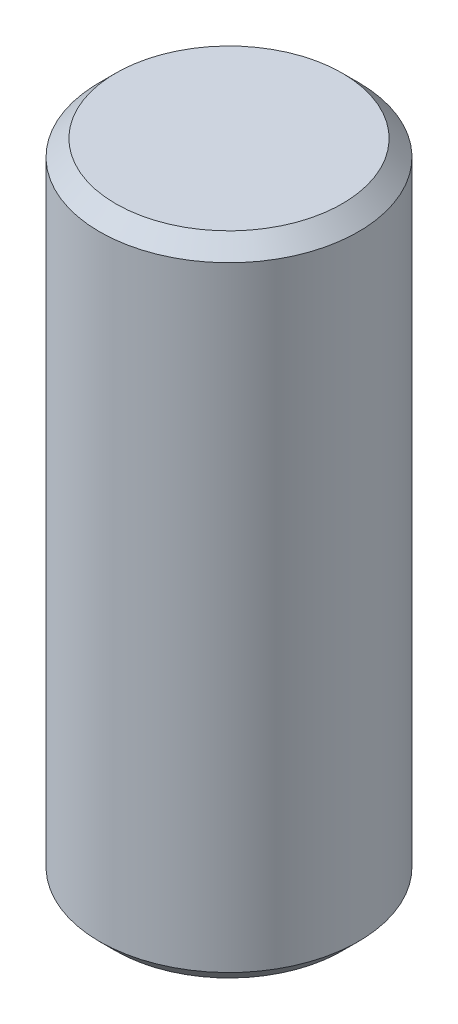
ISO-10303-21;
HEADER;
FILE_DESCRIPTION(('STEP AP214'),'2;1');
FILE_NAME('part.step','',(''),(''),'','','');
FILE_SCHEMA(('AUTOMOTIVE_DESIGN { 1 0 10303 214 1 1 1 1 }'));
ENDSEC;
DATA;
#1=APPLICATION_CONTEXT('core data for automotive mechanical design processes');
#2=APPLICATION_PROTOCOL_DEFINITION('international standard','automotive_design',2000,#1);
#3=PRODUCT_CONTEXT('',#1,'mechanical');
#4=PRODUCT('Part','Part','',(#3));
#5=PRODUCT_RELATED_PRODUCT_CATEGORY('part','',(#4));
#6=PRODUCT_DEFINITION_FORMATION('','',#4);
#7=PRODUCT_DEFINITION_CONTEXT('part definition',#1,'design');
#8=PRODUCT_DEFINITION('design','',#6,#7);
#9=PRODUCT_DEFINITION_SHAPE('','',#8);
#10=(LENGTH_UNIT() NAMED_UNIT(*) SI_UNIT(.MILLI.,.METRE.));
#11=(NAMED_UNIT(*) PLANE_ANGLE_UNIT() SI_UNIT($,.RADIAN.));
#12=(NAMED_UNIT(*) SI_UNIT($,.STERADIAN.) SOLID_ANGLE_UNIT());
#13=UNCERTAINTY_MEASURE_WITH_UNIT(LENGTH_MEASURE(1.E-05),#10,'distance_accuracy_value','');
#14=(GEOMETRIC_REPRESENTATION_CONTEXT(3) GLOBAL_UNCERTAINTY_ASSIGNED_CONTEXT((#13)) GLOBAL_UNIT_ASSIGNED_CONTEXT((#10,
#11,#12)) REPRESENTATION_CONTEXT('',''));
#15=CARTESIAN_POINT('',(0.,0.,0.));
#16=DIRECTION('',(0.,0.,1.));
#17=DIRECTION('',(1.,0.,0.));
#18=AXIS2_PLACEMENT_3D('',#15,#16,#17);
#19=CARTESIAN_POINT('',(0.,40.,0.));
#20=DIRECTION('',(0.,-1.,0.));
#21=DIRECTION('',(0.,0.,-1.));
#22=AXIS2_PLACEMENT_3D('',#19,#20,#21);
#23=CYLINDRICAL_SURFACE('',#22,8.);
#24=CARTESIAN_POINT('',(0.,1.,0.));
#25=DIRECTION('',(0.,1.,0.));
#26=DIRECTION('',(0.,0.,1.));
#27=AXIS2_PLACEMENT_3D('',#24,#25,#26);
#28=CIRCLE('',#27,8.);
#29=CARTESIAN_POINT('',(0.,1.,8.));
#30=VERTEX_POINT('',#29);
#31=EDGE_CURVE('E33',#30,#30,#28,.T.);
#32=ORIENTED_EDGE('',*,*,#31,.T.);
#33=EDGE_LOOP('',(#32));
#34=FACE_BOUND('',#33,.T.);
#35=CARTESIAN_POINT('',(0.,39.,0.));
#36=DIRECTION('',(0.,1.,0.));
#37=DIRECTION('',(0.,0.,1.));
#38=AXIS2_PLACEMENT_3D('',#35,#36,#37);
#39=CIRCLE('',#38,8.);
#40=CARTESIAN_POINT('',(0.,39.,8.));
#41=VERTEX_POINT('',#40);
#42=EDGE_CURVE('E37',#41,#41,#39,.F.);
#43=ORIENTED_EDGE('',*,*,#42,.T.);
#44=EDGE_LOOP('',(#43));
#45=FACE_BOUND('',#44,.T.);
#46=ADVANCED_FACE('F23',(#34,#45),#23,.T.);
#47=CARTESIAN_POINT('',(0.,40.,0.));
#48=DIRECTION('',(0.,1.,0.));
#49=DIRECTION('',(0.,0.,1.));
#50=AXIS2_PLACEMENT_3D('',#47,#48,#49);
#51=PLANE('',#50);
#52=CARTESIAN_POINT('',(0.,40.,0.));
#53=DIRECTION('',(0.,1.,0.));
#54=DIRECTION('',(0.,0.,1.));
#55=AXIS2_PLACEMENT_3D('',#52,#53,#54);
#56=CIRCLE('',#55,7.);
#57=CARTESIAN_POINT('',(0.,40.,7.));
#58=VERTEX_POINT('',#57);
#59=EDGE_CURVE('E10',#58,#58,#56,.T.);
#60=ORIENTED_EDGE('',*,*,#59,.T.);
#61=EDGE_LOOP('',(#60));
#62=FACE_BOUND('',#61,.T.);
#63=ADVANCED_FACE('F56',(#62),#51,.T.);
#64=CARTESIAN_POINT('',(0.,0.,0.));
#65=DIRECTION('',(0.,1.,0.));
#66=DIRECTION('',(0.,0.,1.));
#67=AXIS2_PLACEMENT_3D('',#64,#65,#66);
#68=PLANE('',#67);
#69=CARTESIAN_POINT('',(0.,0.,0.));
#70=DIRECTION('',(0.,1.,0.));
#71=DIRECTION('',(0.,0.,1.));
#72=AXIS2_PLACEMENT_3D('',#69,#70,#71);
#73=CIRCLE('',#72,7.);
#74=CARTESIAN_POINT('',(0.,0.,7.));
#75=VERTEX_POINT('',#74);
#76=EDGE_CURVE('E29',#75,#75,#73,.F.);
#77=ORIENTED_EDGE('',*,*,#76,.T.);
#78=EDGE_LOOP('',(#77));
#79=FACE_BOUND('',#78,.T.);
#80=ADVANCED_FACE('F52',(#79),#68,.F.);
#81=CARTESIAN_POINT('',(0.,1.,0.));
#82=DIRECTION('',(0.,1.,0.));
#83=DIRECTION('',(0.,0.,1.));
#84=AXIS2_PLACEMENT_3D('',#81,#82,#83);
#85=CONICAL_SURFACE('',#84,8.,0.785398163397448);
#86=ORIENTED_EDGE('',*,*,#76,.F.);
#87=EDGE_LOOP('',(#86));
#88=FACE_BOUND('',#87,.T.);
#89=ORIENTED_EDGE('',*,*,#31,.F.);
#90=EDGE_LOOP('',(#89));
#91=FACE_BOUND('',#90,.T.);
#92=ADVANCED_FACE('F47',(#88,#91),#85,.T.);
#93=CARTESIAN_POINT('',(0.,40.,0.));
#94=DIRECTION('',(0.,-1.,0.));
#95=DIRECTION('',(0.,0.,-1.));
#96=AXIS2_PLACEMENT_3D('',#93,#94,#95);
#97=CONICAL_SURFACE('',#96,7.,0.785398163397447);
#98=ORIENTED_EDGE('',*,*,#42,.F.);
#99=EDGE_LOOP('',(#98));
#100=FACE_BOUND('',#99,.T.);
#101=ORIENTED_EDGE('',*,*,#59,.F.);
#102=EDGE_LOOP('',(#101));
#103=FACE_BOUND('',#102,.T.);
#104=ADVANCED_FACE('F44',(#100,#103),#97,.T.);
#105=CLOSED_SHELL('',(#46,#63,#80,#92,#104));
#106=MANIFOLD_SOLID_BREP('B2',#105);
#107=ADVANCED_BREP_SHAPE_REPRESENTATION('',(#18,#106),#14);
#108=SHAPE_DEFINITION_REPRESENTATION(#9,#107);
ENDSEC;
END-ISO-10303-21;
